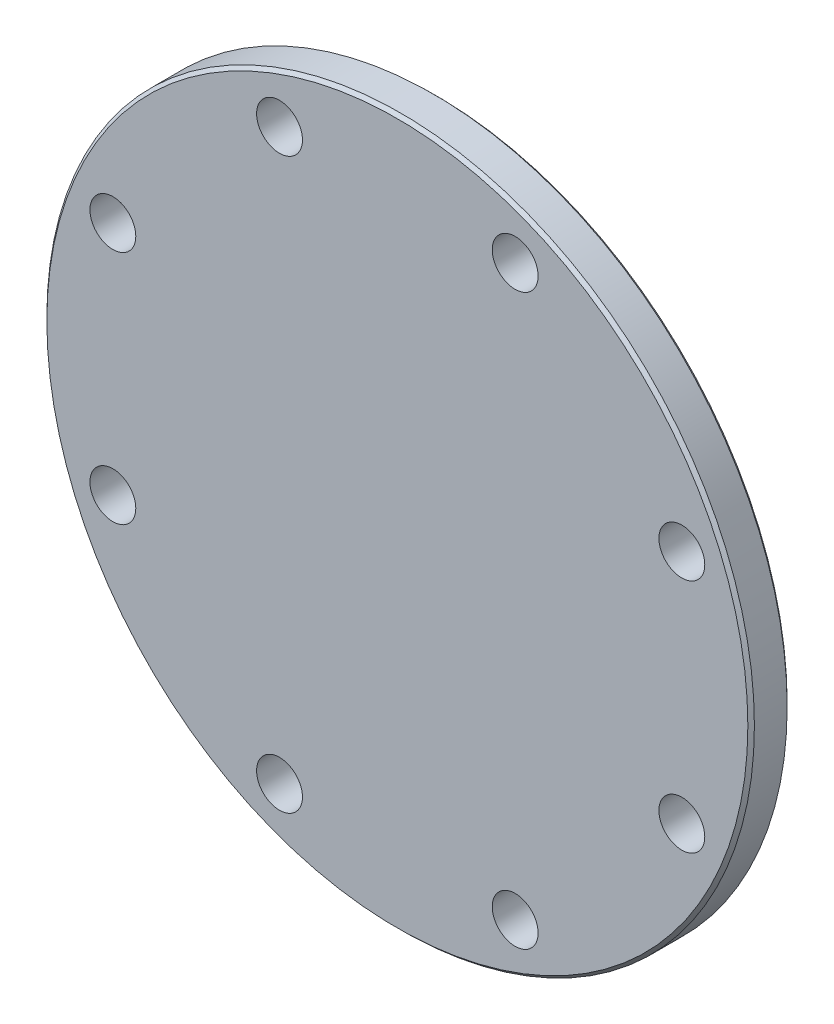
ISO-10303-21;
HEADER;
FILE_DESCRIPTION(('STEP AP214'),'2;1');
FILE_NAME('part.step','',(''),(''),'','','');
FILE_SCHEMA(('AUTOMOTIVE_DESIGN { 1 0 10303 214 1 1 1 1 }'));
ENDSEC;
DATA;
#1=APPLICATION_CONTEXT('core data for automotive mechanical design processes');
#2=APPLICATION_PROTOCOL_DEFINITION('international standard','automotive_design',2000,#1);
#3=PRODUCT_CONTEXT('',#1,'mechanical');
#4=PRODUCT('Part','Part','',(#3));
#5=PRODUCT_RELATED_PRODUCT_CATEGORY('part','',(#4));
#6=PRODUCT_DEFINITION_FORMATION('','',#4);
#7=PRODUCT_DEFINITION_CONTEXT('part definition',#1,'design');
#8=PRODUCT_DEFINITION('design','',#6,#7);
#9=PRODUCT_DEFINITION_SHAPE('','',#8);
#10=(LENGTH_UNIT() NAMED_UNIT(*) SI_UNIT(.MILLI.,.METRE.));
#11=(NAMED_UNIT(*) PLANE_ANGLE_UNIT() SI_UNIT($,.RADIAN.));
#12=(NAMED_UNIT(*) SI_UNIT($,.STERADIAN.) SOLID_ANGLE_UNIT());
#13=UNCERTAINTY_MEASURE_WITH_UNIT(LENGTH_MEASURE(1.E-05),#10,'distance_accuracy_value','');
#14=(GEOMETRIC_REPRESENTATION_CONTEXT(3) GLOBAL_UNCERTAINTY_ASSIGNED_CONTEXT((#13)) GLOBAL_UNIT_ASSIGNED_CONTEXT((#10,
#11,#12)) REPRESENTATION_CONTEXT('',''));
#15=CARTESIAN_POINT('',(0.,0.,0.));
#16=DIRECTION('',(0.,0.,1.));
#17=DIRECTION('',(1.,0.,0.));
#18=AXIS2_PLACEMENT_3D('',#15,#16,#17);
#19=CARTESIAN_POINT('',(0.,0.,19.05));
#20=DIRECTION('',(0.,0.,-1.));
#21=DIRECTION('',(-1.,0.,0.));
#22=AXIS2_PLACEMENT_3D('',#19,#20,#21);
#23=CYLINDRICAL_SURFACE('',#22,171.45);
#24=CARTESIAN_POINT('',(0.,0.,1.58750000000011));
#25=DIRECTION('',(0.,0.,1.));
#26=DIRECTION('',(1.,0.,0.));
#27=AXIS2_PLACEMENT_3D('',#24,#25,#26);
#28=CIRCLE('',#27,171.45);
#29=CARTESIAN_POINT('',(-171.45,0.,1.5875000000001));
#30=VERTEX_POINT('',#29);
#31=EDGE_CURVE('E42',#30,#30,#28,.T.);
#32=CARTESIAN_POINT('',(0.,0.,17.4625000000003));
#33=DIRECTION('',(0.,0.,1.));
#34=DIRECTION('',(1.,0.,0.));
#35=AXIS2_PLACEMENT_3D('',#32,#33,#34);
#36=CIRCLE('',#35,171.45);
#37=CARTESIAN_POINT('',(-171.45,0.,17.4625000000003));
#38=VERTEX_POINT('',#37);
#39=EDGE_CURVE('E46',#38,#38,#36,.F.);
#40=CARTESIAN_POINT('',(-171.45,0.,1.5875000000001));
#41=CARTESIAN_POINT('',(-171.45,0.,1.75286458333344));
#42=CARTESIAN_POINT('',(-171.45,0.,1.91822916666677));
#43=CARTESIAN_POINT('',(-171.45,0.,2.24895833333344));
#44=CARTESIAN_POINT('',(-171.45,0.,2.41432291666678));
#45=CARTESIAN_POINT('',(-171.45,0.,2.74505208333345));
#46=CARTESIAN_POINT('',(-171.45,0.,2.91041666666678));
#47=CARTESIAN_POINT('',(-171.45,0.,3.24114583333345));
#48=CARTESIAN_POINT('',(-171.45,0.,3.40651041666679));
#49=CARTESIAN_POINT('',(-171.45,0.,3.73723958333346));
#50=CARTESIAN_POINT('',(-171.45,0.,3.90260416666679));
#51=CARTESIAN_POINT('',(-171.45,0.,4.23333333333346));
#52=CARTESIAN_POINT('',(-171.45,0.,4.3986979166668));
#53=CARTESIAN_POINT('',(-171.45,0.,4.72942708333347));
#54=CARTESIAN_POINT('',(-171.45,0.,4.8947916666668));
#55=CARTESIAN_POINT('',(-171.45,0.,5.22552083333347));
#56=CARTESIAN_POINT('',(-171.45,0.,5.39088541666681));
#57=CARTESIAN_POINT('',(-171.45,0.,5.72161458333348));
#58=CARTESIAN_POINT('',(-171.45,0.,5.88697916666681));
#59=CARTESIAN_POINT('',(-171.45,0.,6.21770833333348));
#60=CARTESIAN_POINT('',(-171.45,0.,6.38307291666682));
#61=CARTESIAN_POINT('',(-171.45,0.,6.71380208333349));
#62=CARTESIAN_POINT('',(-171.45,0.,6.87916666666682));
#63=CARTESIAN_POINT('',(-171.45,0.,7.20989583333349));
#64=CARTESIAN_POINT('',(-171.45,0.,7.37526041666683));
#65=CARTESIAN_POINT('',(-171.45,0.,7.7059895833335));
#66=CARTESIAN_POINT('',(-171.45,0.,7.87135416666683));
#67=CARTESIAN_POINT('',(-171.45,0.,8.2020833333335));
#68=CARTESIAN_POINT('',(-171.45,0.,8.36744791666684));
#69=CARTESIAN_POINT('',(-171.45,0.,8.6981770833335));
#70=CARTESIAN_POINT('',(-171.45,0.,8.86354166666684));
#71=CARTESIAN_POINT('',(-171.45,0.,9.19427083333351));
#72=CARTESIAN_POINT('',(-171.45,0.,9.35963541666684));
#73=CARTESIAN_POINT('',(-171.45,0.,9.69036458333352));
#74=CARTESIAN_POINT('',(-171.45,0.,9.85572916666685));
#75=CARTESIAN_POINT('',(-171.45,0.,10.1864583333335));
#76=CARTESIAN_POINT('',(-171.45,0.,10.3518229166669));
#77=CARTESIAN_POINT('',(-171.45,0.,10.6825520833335));
#78=CARTESIAN_POINT('',(-171.45,0.,10.8479166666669));
#79=CARTESIAN_POINT('',(-171.45,0.,11.1786458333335));
#80=CARTESIAN_POINT('',(-171.45,0.,11.3440104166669));
#81=CARTESIAN_POINT('',(-171.45,0.,11.6747395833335));
#82=CARTESIAN_POINT('',(-171.45,0.,11.8401041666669));
#83=CARTESIAN_POINT('',(-171.45,0.,12.1708333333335));
#84=CARTESIAN_POINT('',(-171.45,0.,12.3361979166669));
#85=CARTESIAN_POINT('',(-171.45,0.,12.6669270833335));
#86=CARTESIAN_POINT('',(-171.45,0.,12.8322916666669));
#87=CARTESIAN_POINT('',(-171.45,0.,13.1630208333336));
#88=CARTESIAN_POINT('',(-171.45,0.,13.3283854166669));
#89=CARTESIAN_POINT('',(-171.45,0.,13.6591145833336));
#90=CARTESIAN_POINT('',(-171.45,0.,13.8244791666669));
#91=CARTESIAN_POINT('',(-171.45,0.,14.1552083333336));
#92=CARTESIAN_POINT('',(-171.45,0.,14.3205729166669));
#93=CARTESIAN_POINT('',(-171.45,0.,14.6513020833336));
#94=CARTESIAN_POINT('',(-171.45,0.,14.8166666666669));
#95=CARTESIAN_POINT('',(-171.45,0.,15.1473958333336));
#96=CARTESIAN_POINT('',(-171.45,0.,15.3127604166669));
#97=CARTESIAN_POINT('',(-171.45,0.,15.6434895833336));
#98=CARTESIAN_POINT('',(-171.45,0.,15.8088541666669));
#99=CARTESIAN_POINT('',(-171.45,0.,16.1395833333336));
#100=CARTESIAN_POINT('',(-171.45,0.,16.3049479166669));
#101=CARTESIAN_POINT('',(-171.45,0.,16.6356770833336));
#102=CARTESIAN_POINT('',(-171.45,0.,16.8010416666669));
#103=CARTESIAN_POINT('',(-171.45,0.,17.1317708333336));
#104=CARTESIAN_POINT('',(-171.45,0.,17.2971354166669));
#105=CARTESIAN_POINT('',(-171.45,0.,17.4625000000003));
#106=B_SPLINE_CURVE_WITH_KNOTS('',3,(#40,#41,#42,#43,#44,#45,#46,#47,#48,#49,#50,#51,#52,#53,
#54,#55,#56,#57,#58,#59,#60,#61,#62,#63,#64,#65,#66,#67,#68,#69,#70,#71,#72,#73,#74,#75,#76,#77,
#78,#79,#80,#81,#82,#83,#84,#85,#86,#87,#88,#89,#90,#91,#92,#93,#94,#95,#96,#97,#98,#99,#100,
#101,#102,#103,#104,#105),.UNSPECIFIED.,.F.,.F.,(4,2,2,2,2,2,2,2,2,2,2,2,2,2,2,2,2,2,2,2,2,2,2,
2,2,2,2,2,2,2,2,2,4),(0.,0.496093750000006,0.992187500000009,1.48828125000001,1.98437500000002,
2.48046875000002,2.97656250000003,3.47265625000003,3.96875000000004,4.46484375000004,
4.96093750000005,5.45703125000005,5.95312500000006,6.44921875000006,6.94531250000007,
7.44140625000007,7.93750000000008,8.43359375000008,8.92968750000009,9.42578125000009,
9.9218750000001,10.4179687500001,10.9140625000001,11.4101562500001,11.9062500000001,
12.4023437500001,12.8984375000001,13.3945312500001,13.8906250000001,14.3867187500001,
14.8828125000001,15.3789062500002,15.8750000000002),.UNSPECIFIED.);
#107=EDGE_CURVE('BSEAM31',#30,#38,#106,.T.);
#108=ORIENTED_EDGE('',*,*,#31,.T.);
#109=ORIENTED_EDGE('',*,*,#39,.T.);
#110=ORIENTED_EDGE('',*,*,#107,.T.);
#111=ORIENTED_EDGE('',*,*,#107,.F.);
#112=EDGE_LOOP('',(#108,#110,#109,#111));
#113=FACE_BOUND('',#112,.T.);
#114=ADVANCED_FACE('F31',(#113),#23,.T.);
#115=CARTESIAN_POINT('',(0.,0.,19.05));
#116=DIRECTION('',(0.,0.,1.));
#117=DIRECTION('',(1.,0.,0.));
#118=AXIS2_PLACEMENT_3D('',#115,#116,#117);
#119=PLANE('',#118);
#120=CARTESIAN_POINT('',(0.,0.,19.05));
#121=DIRECTION('',(0.,0.,1.));
#122=DIRECTION('',(1.,0.,0.));
#123=AXIS2_PLACEMENT_3D('',#120,#121,#122);
#124=CIRCLE('',#123,169.8625);
#125=CARTESIAN_POINT('',(169.8625,0.,19.05));
#126=VERTEX_POINT('',#125);
#127=EDGE_CURVE('E10',#126,#126,#124,.T.);
#128=ORIENTED_EDGE('',*,*,#127,.T.);
#129=EDGE_LOOP('',(#128));
#130=FACE_BOUND('',#129,.T.);
#131=CARTESIAN_POINT('',(-57.1059351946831,137.865923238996,19.05));
#132=DIRECTION('',(0.,0.,1.));
#133=DIRECTION('',(1.,0.,0.));
#134=AXIS2_PLACEMENT_3D('',#131,#132,#133);
#135=CIRCLE('',#134,11.1125);
#136=CARTESIAN_POINT('',(-45.9934351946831,137.865923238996,19.05));
#137=VERTEX_POINT('',#136);
#138=EDGE_CURVE('E96',#137,#137,#135,.T.);
#139=ORIENTED_EDGE('',*,*,#138,.F.);
#140=EDGE_LOOP('',(#139));
#141=FACE_BOUND('',#140,.T.);
#142=CARTESIAN_POINT('',(57.1059351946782,137.865923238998,19.05));
#143=DIRECTION('',(0.,0.,1.));
#144=DIRECTION('',(1.,0.,0.));
#145=AXIS2_PLACEMENT_3D('',#142,#143,#144);
#146=CIRCLE('',#145,11.1125);
#147=CARTESIAN_POINT('',(68.2184351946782,137.865923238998,19.05));
#148=VERTEX_POINT('',#147);
#149=EDGE_CURVE('E90',#148,#148,#146,.T.);
#150=ORIENTED_EDGE('',*,*,#149,.F.);
#151=EDGE_LOOP('',(#150));
#152=FACE_BOUND('',#151,.T.);
#153=CARTESIAN_POINT('',(137.865923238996,57.1059351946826,19.05));
#154=DIRECTION('',(0.,0.,1.));
#155=DIRECTION('',(1.,0.,0.));
#156=AXIS2_PLACEMENT_3D('',#153,#154,#155);
#157=CIRCLE('',#156,11.1125);
#158=CARTESIAN_POINT('',(148.978423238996,57.1059351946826,19.05));
#159=VERTEX_POINT('',#158);
#160=EDGE_CURVE('E84',#159,#159,#157,.T.);
#161=ORIENTED_EDGE('',*,*,#160,.F.);
#162=EDGE_LOOP('',(#161));
#163=FACE_BOUND('',#162,.T.);
#164=CARTESIAN_POINT('',(137.865923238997,-57.1059351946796,19.05));
#165=DIRECTION('',(0.,0.,1.));
#166=DIRECTION('',(1.,0.,0.));
#167=AXIS2_PLACEMENT_3D('',#164,#165,#166);
#168=CIRCLE('',#167,11.1125);
#169=CARTESIAN_POINT('',(148.978423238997,-57.1059351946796,19.05));
#170=VERTEX_POINT('',#169);
#171=EDGE_CURVE('E78',#170,#170,#168,.T.);
#172=ORIENTED_EDGE('',*,*,#171,.F.);
#173=EDGE_LOOP('',(#172));
#174=FACE_BOUND('',#173,.T.);
#175=CARTESIAN_POINT('',(57.1059351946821,-137.865923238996,19.05));
#176=DIRECTION('',(0.,0.,1.));
#177=DIRECTION('',(1.,0.,0.));
#178=AXIS2_PLACEMENT_3D('',#175,#176,#177);
#179=CIRCLE('',#178,11.1125);
#180=CARTESIAN_POINT('',(68.2184351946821,-137.865923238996,19.05));
#181=VERTEX_POINT('',#180);
#182=EDGE_CURVE('E72',#181,#181,#179,.T.);
#183=ORIENTED_EDGE('',*,*,#182,.F.);
#184=EDGE_LOOP('',(#183));
#185=FACE_BOUND('',#184,.T.);
#186=CARTESIAN_POINT('',(-57.1059351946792,-137.865923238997,19.05));
#187=DIRECTION('',(0.,0.,1.));
#188=DIRECTION('',(1.,0.,0.));
#189=AXIS2_PLACEMENT_3D('',#186,#187,#188);
#190=CIRCLE('',#189,11.1125);
#191=CARTESIAN_POINT('',(-45.9934351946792,-137.865923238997,19.05));
#192=VERTEX_POINT('',#191);
#193=EDGE_CURVE('E66',#192,#192,#190,.T.);
#194=ORIENTED_EDGE('',*,*,#193,.F.);
#195=EDGE_LOOP('',(#194));
#196=FACE_BOUND('',#195,.T.);
#197=CARTESIAN_POINT('',(-137.865923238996,-57.1059351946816,19.05));
#198=DIRECTION('',(0.,0.,1.));
#199=DIRECTION('',(1.,0.,0.));
#200=AXIS2_PLACEMENT_3D('',#197,#198,#199);
#201=CIRCLE('',#200,11.1125);
#202=CARTESIAN_POINT('',(-126.753423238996,-57.1059351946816,19.05));
#203=VERTEX_POINT('',#202);
#204=EDGE_CURVE('E60',#203,#203,#201,.T.);
#205=ORIENTED_EDGE('',*,*,#204,.F.);
#206=EDGE_LOOP('',(#205));
#207=FACE_BOUND('',#206,.T.);
#208=CARTESIAN_POINT('',(-137.865923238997,57.1059351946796,19.05));
#209=DIRECTION('',(0.,0.,1.));
#210=DIRECTION('',(1.,0.,0.));
#211=AXIS2_PLACEMENT_3D('',#208,#209,#210);
#212=CIRCLE('',#211,11.1125);
#213=CARTESIAN_POINT('',(-126.753423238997,57.1059351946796,19.05));
#214=VERTEX_POINT('',#213);
#215=EDGE_CURVE('E54',#214,#214,#212,.T.);
#216=ORIENTED_EDGE('',*,*,#215,.F.);
#217=EDGE_LOOP('',(#216));
#218=FACE_BOUND('',#217,.T.);
#219=ADVANCED_FACE('F102',(#130,#141,#152,#163,#174,#185,#196,#207,#218),#119,.T.);
#220=CARTESIAN_POINT('',(0.,0.,0.));
#221=DIRECTION('',(0.,0.,1.));
#222=DIRECTION('',(1.,0.,0.));
#223=AXIS2_PLACEMENT_3D('',#220,#221,#222);
#224=PLANE('',#223);
#225=CARTESIAN_POINT('',(0.,0.,0.));
#226=DIRECTION('',(0.,0.,1.));
#227=DIRECTION('',(1.,0.,0.));
#228=AXIS2_PLACEMENT_3D('',#225,#226,#227);
#229=CIRCLE('',#228,169.8625);
#230=CARTESIAN_POINT('',(169.8625,0.,0.));
#231=VERTEX_POINT('',#230);
#232=EDGE_CURVE('E38',#231,#231,#229,.F.);
#233=ORIENTED_EDGE('',*,*,#232,.T.);
#234=EDGE_LOOP('',(#233));
#235=FACE_BOUND('',#234,.T.);
#236=CARTESIAN_POINT('',(-57.1059351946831,137.865923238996,0.));
#237=DIRECTION('',(0.,0.,1.));
#238=DIRECTION('',(1.,0.,0.));
#239=AXIS2_PLACEMENT_3D('',#236,#237,#238);
#240=CIRCLE('',#239,11.1125);
#241=CARTESIAN_POINT('',(-45.9934351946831,137.865923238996,0.));
#242=VERTEX_POINT('',#241);
#243=EDGE_CURVE('E93',#242,#242,#240,.T.);
#244=ORIENTED_EDGE('',*,*,#243,.T.);
#245=EDGE_LOOP('',(#244));
#246=FACE_BOUND('',#245,.T.);
#247=CARTESIAN_POINT('',(57.1059351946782,137.865923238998,0.));
#248=DIRECTION('',(0.,0.,1.));
#249=DIRECTION('',(1.,0.,0.));
#250=AXIS2_PLACEMENT_3D('',#247,#248,#249);
#251=CIRCLE('',#250,11.1125);
#252=CARTESIAN_POINT('',(68.2184351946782,137.865923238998,0.));
#253=VERTEX_POINT('',#252);
#254=EDGE_CURVE('E87',#253,#253,#251,.T.);
#255=ORIENTED_EDGE('',*,*,#254,.T.);
#256=EDGE_LOOP('',(#255));
#257=FACE_BOUND('',#256,.T.);
#258=CARTESIAN_POINT('',(137.865923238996,57.1059351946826,0.));
#259=DIRECTION('',(0.,0.,1.));
#260=DIRECTION('',(1.,0.,0.));
#261=AXIS2_PLACEMENT_3D('',#258,#259,#260);
#262=CIRCLE('',#261,11.1125);
#263=CARTESIAN_POINT('',(148.978423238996,57.1059351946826,0.));
#264=VERTEX_POINT('',#263);
#265=EDGE_CURVE('E81',#264,#264,#262,.T.);
#266=ORIENTED_EDGE('',*,*,#265,.T.);
#267=EDGE_LOOP('',(#266));
#268=FACE_BOUND('',#267,.T.);
#269=CARTESIAN_POINT('',(137.865923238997,-57.1059351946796,0.));
#270=DIRECTION('',(0.,0.,1.));
#271=DIRECTION('',(1.,0.,0.));
#272=AXIS2_PLACEMENT_3D('',#269,#270,#271);
#273=CIRCLE('',#272,11.1125);
#274=CARTESIAN_POINT('',(148.978423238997,-57.1059351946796,0.));
#275=VERTEX_POINT('',#274);
#276=EDGE_CURVE('E75',#275,#275,#273,.T.);
#277=ORIENTED_EDGE('',*,*,#276,.T.);
#278=EDGE_LOOP('',(#277));
#279=FACE_BOUND('',#278,.T.);
#280=CARTESIAN_POINT('',(57.1059351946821,-137.865923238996,0.));
#281=DIRECTION('',(0.,0.,1.));
#282=DIRECTION('',(1.,0.,0.));
#283=AXIS2_PLACEMENT_3D('',#280,#281,#282);
#284=CIRCLE('',#283,11.1125);
#285=CARTESIAN_POINT('',(68.2184351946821,-137.865923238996,0.));
#286=VERTEX_POINT('',#285);
#287=EDGE_CURVE('E69',#286,#286,#284,.T.);
#288=ORIENTED_EDGE('',*,*,#287,.T.);
#289=EDGE_LOOP('',(#288));
#290=FACE_BOUND('',#289,.T.);
#291=CARTESIAN_POINT('',(-57.1059351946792,-137.865923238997,0.));
#292=DIRECTION('',(0.,0.,1.));
#293=DIRECTION('',(1.,0.,0.));
#294=AXIS2_PLACEMENT_3D('',#291,#292,#293);
#295=CIRCLE('',#294,11.1125);
#296=CARTESIAN_POINT('',(-45.9934351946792,-137.865923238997,0.));
#297=VERTEX_POINT('',#296);
#298=EDGE_CURVE('E63',#297,#297,#295,.T.);
#299=ORIENTED_EDGE('',*,*,#298,.T.);
#300=EDGE_LOOP('',(#299));
#301=FACE_BOUND('',#300,.T.);
#302=CARTESIAN_POINT('',(-137.865923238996,-57.1059351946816,0.));
#303=DIRECTION('',(0.,0.,1.));
#304=DIRECTION('',(1.,0.,0.));
#305=AXIS2_PLACEMENT_3D('',#302,#303,#304);
#306=CIRCLE('',#305,11.1125);
#307=CARTESIAN_POINT('',(-126.753423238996,-57.1059351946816,0.));
#308=VERTEX_POINT('',#307);
#309=EDGE_CURVE('E57',#308,#308,#306,.T.);
#310=ORIENTED_EDGE('',*,*,#309,.T.);
#311=EDGE_LOOP('',(#310));
#312=FACE_BOUND('',#311,.T.);
#313=CARTESIAN_POINT('',(-137.865923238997,57.1059351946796,0.));
#314=DIRECTION('',(0.,0.,1.));
#315=DIRECTION('',(1.,0.,0.));
#316=AXIS2_PLACEMENT_3D('',#313,#314,#315);
#317=CIRCLE('',#316,11.1125);
#318=CARTESIAN_POINT('',(-126.753423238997,57.1059351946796,0.));
#319=VERTEX_POINT('',#318);
#320=EDGE_CURVE('E51',#319,#319,#317,.T.);
#321=ORIENTED_EDGE('',*,*,#320,.T.);
#322=EDGE_LOOP('',(#321));
#323=FACE_BOUND('',#322,.T.);
#324=ADVANCED_FACE('F105',(#235,#246,#257,#268,#279,#290,#301,#312,#323),#224,.F.);
#325=CARTESIAN_POINT('',(-137.865923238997,57.1059351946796,19.05));
#326=DIRECTION('',(0.,0.,1.));
#327=DIRECTION('',(1.,0.,0.));
#328=AXIS2_PLACEMENT_3D('',#325,#326,#327);
#329=CYLINDRICAL_SURFACE('',#328,11.1125);
#330=ORIENTED_EDGE('',*,*,#320,.F.);
#331=EDGE_LOOP('',(#330));
#332=FACE_BOUND('',#331,.T.);
#333=ORIENTED_EDGE('',*,*,#215,.T.);
#334=EDGE_LOOP('',(#333));
#335=FACE_BOUND('',#334,.T.);
#336=ADVANCED_FACE('F121',(#332,#335),#329,.F.);
#337=CARTESIAN_POINT('',(-137.865923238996,-57.1059351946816,19.05));
#338=DIRECTION('',(0.,0.,1.));
#339=DIRECTION('',(1.,0.,0.));
#340=AXIS2_PLACEMENT_3D('',#337,#338,#339);
#341=CYLINDRICAL_SURFACE('',#340,11.1125);
#342=ORIENTED_EDGE('',*,*,#309,.F.);
#343=EDGE_LOOP('',(#342));
#344=FACE_BOUND('',#343,.T.);
#345=ORIENTED_EDGE('',*,*,#204,.T.);
#346=EDGE_LOOP('',(#345));
#347=FACE_BOUND('',#346,.T.);
#348=ADVANCED_FACE('F123',(#344,#347),#341,.F.);
#349=CARTESIAN_POINT('',(-57.1059351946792,-137.865923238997,19.05));
#350=DIRECTION('',(0.,0.,1.));
#351=DIRECTION('',(1.,0.,0.));
#352=AXIS2_PLACEMENT_3D('',#349,#350,#351);
#353=CYLINDRICAL_SURFACE('',#352,11.1125);
#354=ORIENTED_EDGE('',*,*,#298,.F.);
#355=EDGE_LOOP('',(#354));
#356=FACE_BOUND('',#355,.T.);
#357=ORIENTED_EDGE('',*,*,#193,.T.);
#358=EDGE_LOOP('',(#357));
#359=FACE_BOUND('',#358,.T.);
#360=ADVANCED_FACE('F130',(#356,#359),#353,.F.);
#361=CARTESIAN_POINT('',(57.1059351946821,-137.865923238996,19.05));
#362=DIRECTION('',(0.,0.,1.));
#363=DIRECTION('',(1.,0.,0.));
#364=AXIS2_PLACEMENT_3D('',#361,#362,#363);
#365=CYLINDRICAL_SURFACE('',#364,11.1125);
#366=ORIENTED_EDGE('',*,*,#287,.F.);
#367=EDGE_LOOP('',(#366));
#368=FACE_BOUND('',#367,.T.);
#369=ORIENTED_EDGE('',*,*,#182,.T.);
#370=EDGE_LOOP('',(#369));
#371=FACE_BOUND('',#370,.T.);
#372=ADVANCED_FACE('F168',(#368,#371),#365,.F.);
#373=CARTESIAN_POINT('',(137.865923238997,-57.1059351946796,19.05));
#374=DIRECTION('',(0.,0.,1.));
#375=DIRECTION('',(1.,0.,0.));
#376=AXIS2_PLACEMENT_3D('',#373,#374,#375);
#377=CYLINDRICAL_SURFACE('',#376,11.1125);
#378=ORIENTED_EDGE('',*,*,#276,.F.);
#379=EDGE_LOOP('',(#378));
#380=FACE_BOUND('',#379,.T.);
#381=ORIENTED_EDGE('',*,*,#171,.T.);
#382=EDGE_LOOP('',(#381));
#383=FACE_BOUND('',#382,.T.);
#384=ADVANCED_FACE('F164',(#380,#383),#377,.F.);
#385=CARTESIAN_POINT('',(137.865923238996,57.1059351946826,19.05));
#386=DIRECTION('',(0.,0.,1.));
#387=DIRECTION('',(1.,0.,0.));
#388=AXIS2_PLACEMENT_3D('',#385,#386,#387);
#389=CYLINDRICAL_SURFACE('',#388,11.1125);
#390=ORIENTED_EDGE('',*,*,#265,.F.);
#391=EDGE_LOOP('',(#390));
#392=FACE_BOUND('',#391,.T.);
#393=ORIENTED_EDGE('',*,*,#160,.T.);
#394=EDGE_LOOP('',(#393));
#395=FACE_BOUND('',#394,.T.);
#396=ADVANCED_FACE('F157',(#392,#395),#389,.F.);
#397=CARTESIAN_POINT('',(57.1059351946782,137.865923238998,19.05));
#398=DIRECTION('',(0.,0.,1.));
#399=DIRECTION('',(1.,0.,0.));
#400=AXIS2_PLACEMENT_3D('',#397,#398,#399);
#401=CYLINDRICAL_SURFACE('',#400,11.1125);
#402=ORIENTED_EDGE('',*,*,#254,.F.);
#403=EDGE_LOOP('',(#402));
#404=FACE_BOUND('',#403,.T.);
#405=ORIENTED_EDGE('',*,*,#149,.T.);
#406=EDGE_LOOP('',(#405));
#407=FACE_BOUND('',#406,.T.);
#408=ADVANCED_FACE('F149',(#404,#407),#401,.F.);
#409=CARTESIAN_POINT('',(-57.1059351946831,137.865923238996,19.05));
#410=DIRECTION('',(0.,0.,1.));
#411=DIRECTION('',(1.,0.,0.));
#412=AXIS2_PLACEMENT_3D('',#409,#410,#411);
#413=CYLINDRICAL_SURFACE('',#412,11.1125);
#414=ORIENTED_EDGE('',*,*,#243,.F.);
#415=EDGE_LOOP('',(#414));
#416=FACE_BOUND('',#415,.T.);
#417=ORIENTED_EDGE('',*,*,#138,.T.);
#418=EDGE_LOOP('',(#417));
#419=FACE_BOUND('',#418,.T.);
#420=ADVANCED_FACE('F100',(#416,#419),#413,.F.);
#421=CARTESIAN_POINT('',(0.,0.,1.5875000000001));
#422=DIRECTION('',(0.,0.,1.));
#423=DIRECTION('',(1.,0.,0.));
#424=AXIS2_PLACEMENT_3D('',#421,#422,#423);
#425=CONICAL_SURFACE('',#424,171.45,0.78539816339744);
#426=ORIENTED_EDGE('',*,*,#232,.F.);
#427=EDGE_LOOP('',(#426));
#428=FACE_BOUND('',#427,.T.);
#429=ORIENTED_EDGE('',*,*,#31,.F.);
#430=EDGE_LOOP('',(#429));
#431=FACE_BOUND('',#430,.T.);
#432=ADVANCED_FACE('F141',(#428,#431),#425,.T.);
#433=CARTESIAN_POINT('',(0.,0.,19.05));
#434=DIRECTION('',(0.,0.,-1.));
#435=DIRECTION('',(-1.,0.,0.));
#436=AXIS2_PLACEMENT_3D('',#433,#434,#435);
#437=CONICAL_SURFACE('',#436,169.8625,0.785398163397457);
#438=ORIENTED_EDGE('',*,*,#39,.F.);
#439=EDGE_LOOP('',(#438));
#440=FACE_BOUND('',#439,.T.);
#441=ORIENTED_EDGE('',*,*,#127,.F.);
#442=EDGE_LOOP('',(#441));
#443=FACE_BOUND('',#442,.T.);
#444=ADVANCED_FACE('F33',(#440,#443),#437,.T.);
#445=CLOSED_SHELL('',(#114,#219,#324,#336,#348,#360,#372,#384,#396,#408,#420,#432,#444));
#446=MANIFOLD_SOLID_BREP('B2',#445);
#447=ADVANCED_BREP_SHAPE_REPRESENTATION('',(#18,#446),#14);
#448=SHAPE_DEFINITION_REPRESENTATION(#9,#447);
ENDSEC;
END-ISO-10303-21;
